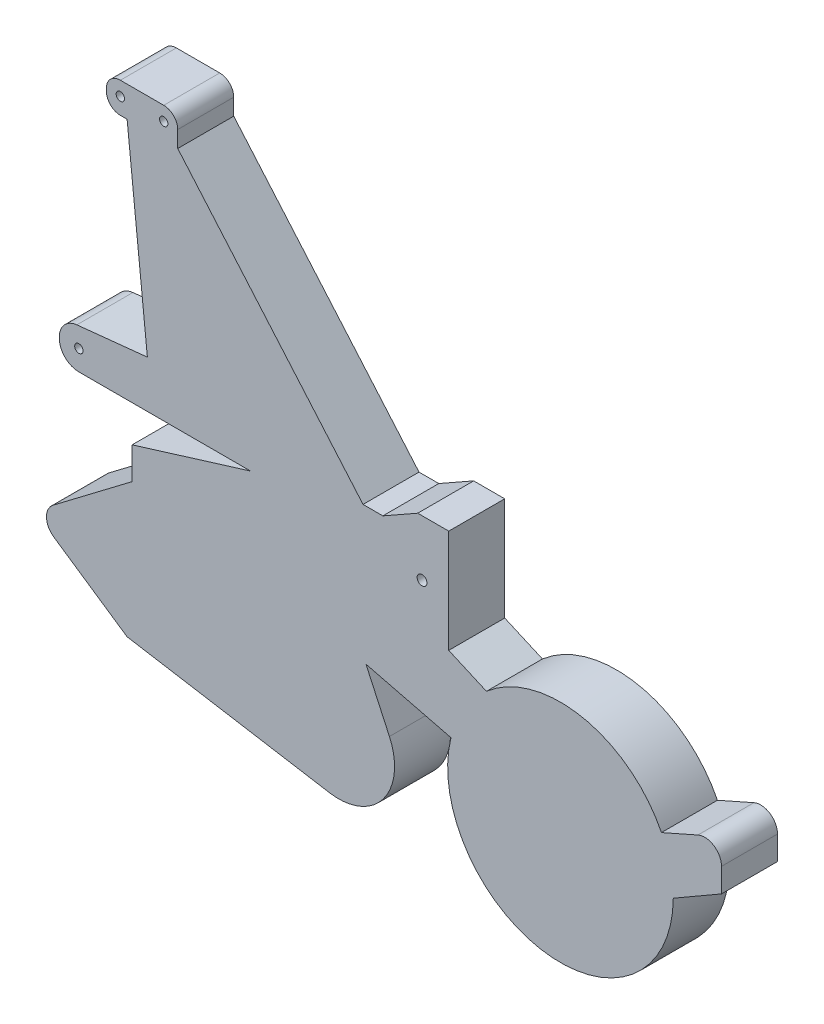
from build123d import *

# Parameters (mm, degrees)
EXTRUSION1_DEPTH        = 10
ESQUISSE4_R             = 0.75
ENL_V_MAT_EXTRU_1_DEPTH = 109.72253214
ECHELLE1_SCALE          = 11.36
ESQUISSE5_R             = 10
ENL_V_MAT_EXTRU_2_DEPTH = 1030.203896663


with BuildPart() as part:
    # Esquisse1 → Extrusion1 (new body)
    with BuildSketch(Plane.XY):
        with BuildLine():
            Line((77.86478521, -50.199965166), (69.249345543, -55.179526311))
            ThreePointArc((69.249345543, -55.179526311), (46.590891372, -75.060806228), (29.54362126, -50.199965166))
            Line((29.54362126, -50.199965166), (14.359067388, -46.421265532))
            Line((14.359067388, -46.421265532), (18.549982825, -55.51016664))
            ThreePointArc((18.549982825, -55.51016664), (17.416373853, -65.766866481), (7.819882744, -69.56058752))
            Line((7.819882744, -69.56058752), (-28.303810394, -63.521109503))
            Line((-28.303810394, -63.521109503), (-41.389643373, -54.638125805))
            ThreePointArc((-41.389643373, -54.638125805), (-42.703684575, -52.234386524), (-41.517024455, -49.765276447))
            Line((-41.517024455, -49.765276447), (-27.397475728, -39.061747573))
            Line((-27.397475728, -39.061747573), (-27.397475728, -33.365242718))
            Line((-27.397475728, -33.365242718), (-6.239029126, -26.854951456))
            Line((-6.239029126, -26.854951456), (-36.918058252, -26.854951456))
            ThreePointArc((-36.918058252, -26.854951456), (-39.392931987, -25.82982519), (-40.418058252, -23.354951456))
            Line((-40.418058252, -23.354951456), (-40.418058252, -23.23000696))
            ThreePointArc((-40.418058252, -23.23000696), (-39.517146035, -20.885920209), (-37.278205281, -19.748585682))
            Line((-37.278205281, -19.748585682), (-24.684854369, -18.445825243))
            Line((-24.684854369, -18.445825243), (-25.312905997, -12.374659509))
            Line((-25.312905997, -12.374659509), (-28.303810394, 16.537416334))
            Line((-28.303810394, 16.537416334), (-29.508932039, 16.537416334))
            ThreePointArc((-29.508932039, 16.537416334), (-31.276698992, 17.269649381), (-32.008932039, 19.037416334))
            Line((-32.008932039, 19.037416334), (-32.008932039, 19.47223301))
            ThreePointArc((-32.008932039, 19.47223301), (-31.276698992, 21.239999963), (-29.508932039, 21.97223301))
            Line((-29.508932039, 21.97223301), (-21.75961165, 21.97223301))
            ThreePointArc((-21.75961165, 21.97223301), (-19.991844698, 21.239999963), (-19.25961165, 19.47223301))
            Line((-19.25961165, 19.47223301), (-19.25961165, 16.537416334))
            Line((-19.25961165, 16.537416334), (13.834368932, -21.97223301))
            Line((13.834368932, -21.97223301), (17.372036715, -21.97223301))
            Line((17.372036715, -21.97223301), (23.599805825, -18.445825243))
            Line((23.599805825, -18.445825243), (29.142695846, -18.445825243))
            Line((29.142695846, -18.445825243), (29.142695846, -36.891650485))
            Line((29.142695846, -36.891650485), (35.880975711, -39.855361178))
            ThreePointArc((35.880975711, -39.855361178), (53.035108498, -35.303261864), (67.135609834, -46.081097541))
            Line((67.135609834, -46.081097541), (73.650864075, -43.198164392))
            ThreePointArc((73.650864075, -43.198164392), (76.501598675, -43.427447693), (77.864799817, -45.941595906))
            Line((77.864799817, -45.941595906), (77.86478521, -50.199965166))
        make_face()
    extrude(amount=-EXTRUSION1_DEPTH)

    # Esquisse4 → Enl_v. mat.-Extru.1 (cut, through all)
    with BuildSketch(Plane.XY):
        with Locations((-29.508932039, 19.47223301)):
            Circle(ESQUISSE4_R)
        with Locations((-36.918058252, -23.23000696)):
            Circle(ESQUISSE4_R)
        with Locations((-21.75961165, 19.47223301)):
            Circle(ESQUISSE4_R)
        with Locations((179.163162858, 81.185314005)):
            Circle(ESQUISSE4_R)
    extrude(amount=-ENL_V_MAT_EXTRU_1_DEPTH, mode=Mode.SUBTRACT)


with BuildPart() as part_1:
    # Echelle1: scaled about (9.433127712, -39.001743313, -5)
    add(part.part.scale(ECHELLE1_SCALE).moved(Location((-97.727203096, 404.058060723, 51.8))))

    # Esquisse5 → Enl_v. mat.-Extru.2 (cut, through all)
    with BuildSketch(Plane.XY.offset(51.8)):
        with Locations((179.163162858, 81.185314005)):
            Circle(ESQUISSE5_R)
    extrude(amount=-ENL_V_MAT_EXTRU_2_DEPTH, mode=Mode.SUBTRACT)


solid = part_1.part
